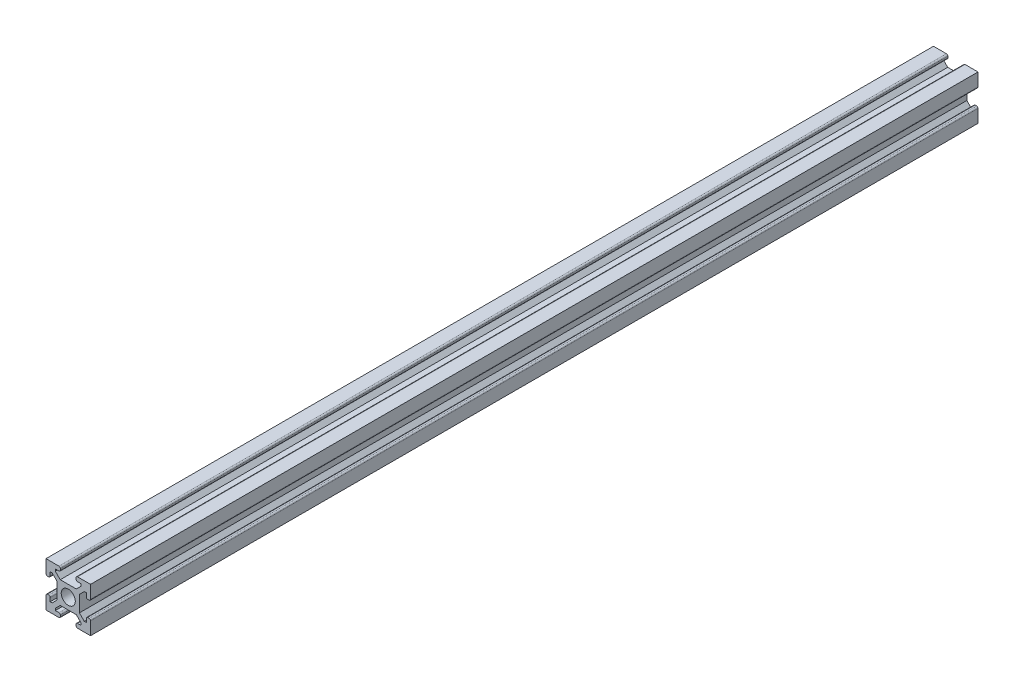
from build123d import *

# Parameters (mm, degrees)
SKETCH1_W           = 20.066
SKETCH1_H           = 20.066
SKETCH1_R           = 6.35
BOSS_EXTRUDE1_DEPTH = 800.00094
FILLET1_R           = 1.27


with BuildPart() as part:
    # Sketch1 → Boss-Extrude1 (new body)
    # profile 1 of 5: a face of its own
    with BuildSketch(Plane.XY):
        Polygon((-7.10421319, 16.256), (-7.10421319, 20.066), (-20.066, 20.066), (-20.066, 7.10421319), (-16.256, 7.10421319), (-16.256, 11.67621319), (-14.478, 11.67621319), (-10.033, 7.23121319), (-10.033, 10.033), (-7.23121319, 10.033), (-11.67621319, 14.478), (-11.67621319, 16.256), align=None)
    # profile 2 of 5: a face of its own
    with BuildSketch(Plane.XY):
        Rectangle(SKETCH1_W, SKETCH1_H)
        with Locations(Location((0, 0, 0), (0, 0, 180))):
            Circle(SKETCH1_R, mode=Mode.SUBTRACT)
    # profile 3 of 5: a face of its own
    with BuildSketch(Plane.XY):
        Polygon((20.066, 20.066), (7.10421319, 20.066), (7.10421319, 16.256), (11.67621319, 16.256), (11.67621319, 14.478), (7.23121319, 10.033), (10.033, 10.033), (10.033, 7.23121319), (14.478, 11.67621319), (16.256, 11.67621319), (16.256, 7.10421319), (20.066, 7.10421319), align=None)
    # profile 4 of 5: a face of its own
    with BuildSketch(Plane.XY):
        Polygon((-16.256, -7.10421319), (-20.066, -7.10421319), (-20.066, -20.066), (-7.10421319, -20.066), (-7.10421319, -16.256), (-11.67621319, -16.256), (-11.67621319, -14.478), (-7.23121319, -10.033), (-10.033, -10.033), (-10.033, -7.23121319), (-14.478, -11.67621319), (-16.256, -11.67621319), align=None)
    # profile 5 of 5: a face of its own
    with BuildSketch(Plane.XY):
        Polygon((20.066, -20.066), (20.066, -7.10421319), (16.256, -7.10421319), (16.256, -11.67621319), (14.478, -11.67621319), (10.033, -7.23121319), (10.033, -10.033), (7.23121319, -10.033), (11.67621319, -14.478), (11.67621319, -16.256), (7.10421319, -16.256), (7.10421319, -20.066), align=None)
    extrude(amount=BOSS_EXTRUDE1_DEPTH)

    # Fillet1
    fillet1_edges = [part.edges().sort_by_distance(p)[0] for p in [
        (16.256, -7.10421319, 400.00047),
        (20.066, -7.10421319, 400.00047),
        (7.10421319, -20.066, 400.00047),
        (7.10421319, -16.256, 400.00047),
        (-7.10421319, -16.256, 400.00047),
        (-7.10421319, -20.066, 400.00047),
        (-20.066, -7.10421319, 400.00047),
        (-16.256, -7.10421319, 400.00047),
        (-16.256, 7.10421319, 400.00047),
        (-20.066, 7.10421319, 400.00047),
        (-7.10421319, 20.066, 400.00047),
        (-7.10421319, 16.256, 400.00047),
        (7.10421319, 16.256, 400.00047),
        (7.10421319, 20.066, 400.00047),
        (20.066, 7.10421319, 400.00047),
        (16.256, 7.10421319, 400.00047),
    ]]
    fillet(fillet1_edges, radius=FILLET1_R)


solid = part.part
